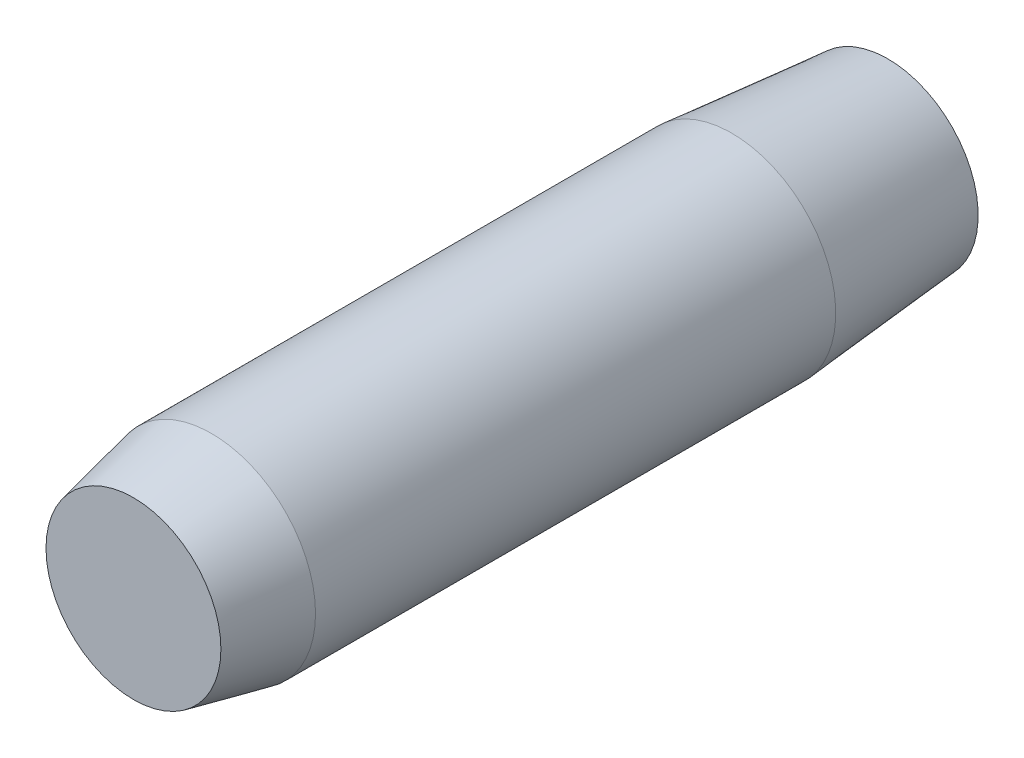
ISO-10303-21;
HEADER;
FILE_DESCRIPTION(('STEP AP214'),'2;1');
FILE_NAME('part.step','',(''),(''),'','','');
FILE_SCHEMA(('AUTOMOTIVE_DESIGN { 1 0 10303 214 1 1 1 1 }'));
ENDSEC;
DATA;
#1=APPLICATION_CONTEXT('core data for automotive mechanical design processes');
#2=APPLICATION_PROTOCOL_DEFINITION('international standard','automotive_design',2000,#1);
#3=PRODUCT_CONTEXT('',#1,'mechanical');
#4=PRODUCT('Part','Part','',(#3));
#5=PRODUCT_RELATED_PRODUCT_CATEGORY('part','',(#4));
#6=PRODUCT_DEFINITION_FORMATION('','',#4);
#7=PRODUCT_DEFINITION_CONTEXT('part definition',#1,'design');
#8=PRODUCT_DEFINITION('design','',#6,#7);
#9=PRODUCT_DEFINITION_SHAPE('','',#8);
#10=(LENGTH_UNIT() NAMED_UNIT(*) SI_UNIT(.MILLI.,.METRE.));
#11=(NAMED_UNIT(*) PLANE_ANGLE_UNIT() SI_UNIT($,.RADIAN.));
#12=(NAMED_UNIT(*) SI_UNIT($,.STERADIAN.) SOLID_ANGLE_UNIT());
#13=UNCERTAINTY_MEASURE_WITH_UNIT(LENGTH_MEASURE(1.E-05),#10,'distance_accuracy_value','');
#14=(GEOMETRIC_REPRESENTATION_CONTEXT(3) GLOBAL_UNCERTAINTY_ASSIGNED_CONTEXT((#13)) GLOBAL_UNIT_ASSIGNED_CONTEXT((#10,
#11,#12)) REPRESENTATION_CONTEXT('',''));
#15=CARTESIAN_POINT('',(0.,0.,0.));
#16=DIRECTION('',(0.,0.,1.));
#17=DIRECTION('',(1.,0.,0.));
#18=AXIS2_PLACEMENT_3D('',#15,#16,#17);
#19=CARTESIAN_POINT('',(0.,0.,100.));
#20=DIRECTION('',(0.,0.,-1.));
#21=DIRECTION('',(-1.,0.,0.));
#22=AXIS2_PLACEMENT_3D('',#19,#20,#21);
#23=CYLINDRICAL_SURFACE('',#22,20.);
#24=CARTESIAN_POINT('',(0.,0.,100.));
#25=DIRECTION('',(0.,0.,1.));
#26=DIRECTION('',(1.,0.,0.));
#27=AXIS2_PLACEMENT_3D('',#24,#25,#26);
#28=CIRCLE('',#27,20.);
#29=CARTESIAN_POINT('',(20.,0.,100.));
#30=VERTEX_POINT('',#29);
#31=EDGE_CURVE('E12',#30,#30,#28,.T.);
#32=ORIENTED_EDGE('',*,*,#31,.F.);
#33=EDGE_LOOP('',(#32));
#34=FACE_BOUND('',#33,.T.);
#35=CARTESIAN_POINT('',(0.,0.,0.));
#36=DIRECTION('',(0.,0.,-1.));
#37=DIRECTION('',(-1.,0.,0.));
#38=AXIS2_PLACEMENT_3D('',#35,#36,#37);
#39=CIRCLE('',#38,20.);
#40=CARTESIAN_POINT('',(-20.,0.,0.));
#41=VERTEX_POINT('',#40);
#42=EDGE_CURVE('E57',#41,#41,#39,.T.);
#43=ORIENTED_EDGE('',*,*,#42,.F.);
#44=EDGE_LOOP('',(#43));
#45=FACE_BOUND('',#44,.T.);
#46=ADVANCED_FACE('F43',(#34,#45),#23,.T.);
#47=CARTESIAN_POINT('',(0.,0.,100.));
#48=DIRECTION('',(0.,0.,-1.));
#49=DIRECTION('',(1.,0.,0.));
#50=AXIS2_PLACEMENT_3D('',#47,#48,#49);
#51=CONICAL_SURFACE('',#50,20.,0.20943951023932);
#52=CARTESIAN_POINT('',(0.,0.,115.));
#53=DIRECTION('',(0.,0.,1.));
#54=DIRECTION('',(1.,0.,0.));
#55=AXIS2_PLACEMENT_3D('',#52,#53,#54);
#56=CIRCLE('',#55,16.8116515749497);
#57=CARTESIAN_POINT('',(16.8116515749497,0.,115.));
#58=VERTEX_POINT('',#57);
#59=EDGE_CURVE('E49',#58,#58,#56,.T.);
#60=ORIENTED_EDGE('',*,*,#59,.F.);
#61=EDGE_LOOP('',(#60));
#62=FACE_BOUND('',#61,.T.);
#63=ORIENTED_EDGE('',*,*,#31,.T.);
#64=EDGE_LOOP('',(#63));
#65=FACE_BOUND('',#64,.T.);
#66=ADVANCED_FACE('F66',(#62,#65),#51,.T.);
#67=CARTESIAN_POINT('',(0.,0.,115.));
#68=DIRECTION('',(0.,0.,1.));
#69=DIRECTION('',(1.,0.,0.));
#70=AXIS2_PLACEMENT_3D('',#67,#68,#69);
#71=PLANE('',#70);
#72=ORIENTED_EDGE('',*,*,#59,.T.);
#73=EDGE_LOOP('',(#72));
#74=FACE_BOUND('',#73,.T.);
#75=ADVANCED_FACE('F71',(#74),#71,.T.);
#76=CARTESIAN_POINT('',(0.,0.,0.));
#77=DIRECTION('',(0.,0.,1.));
#78=DIRECTION('',(-1.,0.,0.));
#79=AXIS2_PLACEMENT_3D('',#76,#77,#78);
#80=CONICAL_SURFACE('',#79,20.,0.0872664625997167);
#81=CARTESIAN_POINT('',(0.,0.,-30.));
#82=DIRECTION('',(0.,0.,-1.));
#83=DIRECTION('',(-1.,0.,0.));
#84=AXIS2_PLACEMENT_3D('',#81,#82,#83);
#85=CIRCLE('',#84,17.3753400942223);
#86=CARTESIAN_POINT('',(-17.3753400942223,0.,-30.));
#87=VERTEX_POINT('',#86);
#88=EDGE_CURVE('E53',#87,#87,#85,.T.);
#89=ORIENTED_EDGE('',*,*,#88,.F.);
#90=EDGE_LOOP('',(#89));
#91=FACE_BOUND('',#90,.T.);
#92=ORIENTED_EDGE('',*,*,#42,.T.);
#93=EDGE_LOOP('',(#92));
#94=FACE_BOUND('',#93,.T.);
#95=ADVANCED_FACE('F63',(#91,#94),#80,.T.);
#96=CARTESIAN_POINT('',(0.,0.,-30.));
#97=DIRECTION('',(0.,0.,-1.));
#98=DIRECTION('',(-1.,0.,0.));
#99=AXIS2_PLACEMENT_3D('',#96,#97,#98);
#100=PLANE('',#99);
#101=ORIENTED_EDGE('',*,*,#88,.T.);
#102=EDGE_LOOP('',(#101));
#103=FACE_BOUND('',#102,.T.);
#104=ADVANCED_FACE('F80',(#103),#100,.T.);
#105=CLOSED_SHELL('',(#46,#66,#75,#95,#104));
#106=MANIFOLD_SOLID_BREP('B2',#105);
#107=ADVANCED_BREP_SHAPE_REPRESENTATION('',(#18,#106),#14);
#108=SHAPE_DEFINITION_REPRESENTATION(#9,#107);
ENDSEC;
END-ISO-10303-21;
